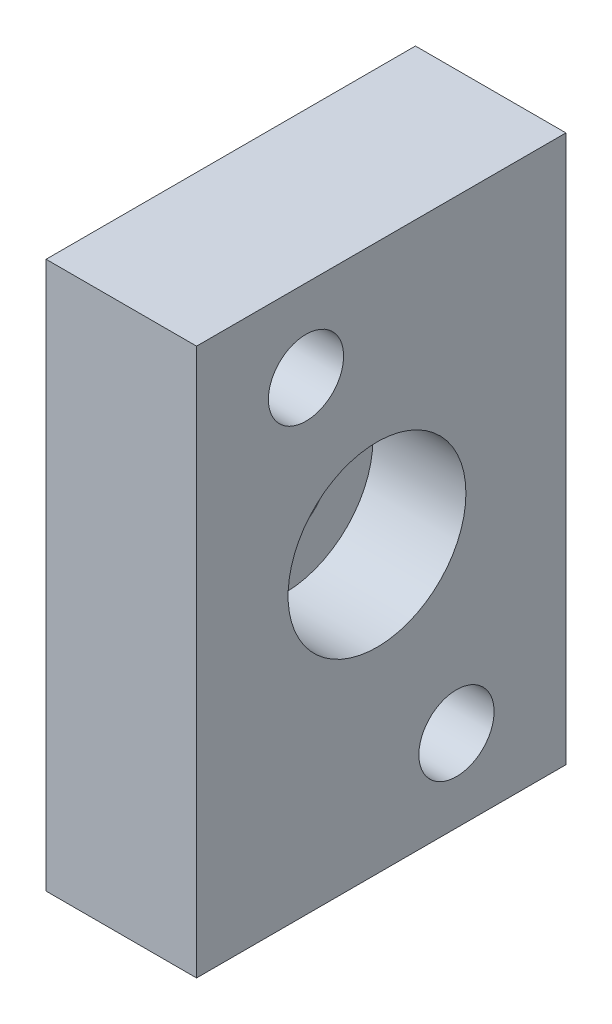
ISO-10303-21;
HEADER;
FILE_DESCRIPTION(('STEP AP214'),'2;1');
FILE_NAME('part.step','',(''),(''),'','','');
FILE_SCHEMA(('AUTOMOTIVE_DESIGN { 1 0 10303 214 1 1 1 1 }'));
ENDSEC;
DATA;
#1=APPLICATION_CONTEXT('core data for automotive mechanical design processes');
#2=APPLICATION_PROTOCOL_DEFINITION('international standard','automotive_design',2000,#1);
#3=PRODUCT_CONTEXT('',#1,'mechanical');
#4=PRODUCT('Part','Part','',(#3));
#5=PRODUCT_RELATED_PRODUCT_CATEGORY('part','',(#4));
#6=PRODUCT_DEFINITION_FORMATION('','',#4);
#7=PRODUCT_DEFINITION_CONTEXT('part definition',#1,'design');
#8=PRODUCT_DEFINITION('design','',#6,#7);
#9=PRODUCT_DEFINITION_SHAPE('','',#8);
#10=(LENGTH_UNIT() NAMED_UNIT(*) SI_UNIT(.MILLI.,.METRE.));
#11=(NAMED_UNIT(*) PLANE_ANGLE_UNIT() SI_UNIT($,.RADIAN.));
#12=(NAMED_UNIT(*) SI_UNIT($,.STERADIAN.) SOLID_ANGLE_UNIT());
#13=UNCERTAINTY_MEASURE_WITH_UNIT(LENGTH_MEASURE(1.E-05),#10,'distance_accuracy_value','');
#14=(GEOMETRIC_REPRESENTATION_CONTEXT(3) GLOBAL_UNCERTAINTY_ASSIGNED_CONTEXT((#13)) GLOBAL_UNIT_ASSIGNED_CONTEXT((#10,
#11,#12)) REPRESENTATION_CONTEXT('',''));
#15=CARTESIAN_POINT('',(0.,0.,0.));
#16=DIRECTION('',(0.,0.,1.));
#17=DIRECTION('',(1.,0.,0.));
#18=AXIS2_PLACEMENT_3D('',#15,#16,#17);
#19=CARTESIAN_POINT('',(110.,-61.85,-2.));
#20=DIRECTION('',(-1.,0.,0.));
#21=DIRECTION('',(0.,0.,-1.));
#22=AXIS2_PLACEMENT_3D('',#19,#20,#21);
#23=PLANE('',#22);
#24=CARTESIAN_POINT('',(110.,-55.85,-21.));
#25=DIRECTION('',(-1.,0.,0.));
#26=DIRECTION('',(0.,0.,1.));
#27=AXIS2_PLACEMENT_3D('',#24,#25,#26);
#28=CIRCLE('',#27,4.50000000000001);
#29=CARTESIAN_POINT('',(110.,-55.85,-16.5));
#30=VERTEX_POINT('',#29);
#31=EDGE_CURVE('E182',#30,#30,#28,.T.);
#32=ORIENTED_EDGE('',*,*,#31,.F.);
#33=EDGE_LOOP('',(#32));
#34=FACE_BOUND('',#33,.T.);
#35=CARTESIAN_POINT('',(110.,-27.85,-10.));
#36=DIRECTION('',(-1.,0.,0.));
#37=DIRECTION('',(0.,0.,1.));
#38=AXIS2_PLACEMENT_3D('',#35,#36,#37);
#39=CIRCLE('',#38,4.5);
#40=CARTESIAN_POINT('',(110.,-27.85,-5.5));
#41=VERTEX_POINT('',#40);
#42=EDGE_CURVE('E188',#41,#41,#39,.T.);
#43=ORIENTED_EDGE('',*,*,#42,.F.);
#44=EDGE_LOOP('',(#43));
#45=FACE_BOUND('',#44,.T.);
#46=CARTESIAN_POINT('',(110.,-41.01,-15.19));
#47=DIRECTION('',(1.,0.,0.));
#48=DIRECTION('',(0.,0.,-1.));
#49=AXIS2_PLACEMENT_3D('',#46,#47,#48);
#50=CIRCLE('',#49,3.2);
#51=CARTESIAN_POINT('',(110.,-41.01,-18.39));
#52=VERTEX_POINT('',#51);
#53=EDGE_CURVE('E197',#52,#52,#50,.T.);
#54=ORIENTED_EDGE('',*,*,#53,.T.);
#55=EDGE_LOOP('',(#54));
#56=FACE_BOUND('',#55,.T.);
#57=DIRECTION('',(0.,-1.,0.));
#58=VECTOR('',#57,1.);
#59=CARTESIAN_POINT('',(110.,-21.85,-2.));
#60=LINE('',#59,#58);
#61=CARTESIAN_POINT('',(110.,-21.85,-2.));
#62=VERTEX_POINT('',#61);
#63=CARTESIAN_POINT('',(110.,-61.85,-2.));
#64=VERTEX_POINT('',#63);
#65=EDGE_CURVE('E87',#62,#64,#60,.T.);
#66=ORIENTED_EDGE('',*,*,#65,.F.);
#67=DIRECTION('',(0.,0.,1.));
#68=VECTOR('',#67,1.);
#69=CARTESIAN_POINT('',(110.,-21.85,-29.));
#70=LINE('',#69,#68);
#71=CARTESIAN_POINT('',(110.,-21.85,-29.));
#72=VERTEX_POINT('',#71);
#73=EDGE_CURVE('E70',#72,#62,#70,.T.);
#74=ORIENTED_EDGE('',*,*,#73,.F.);
#75=DIRECTION('',(0.,1.,0.));
#76=VECTOR('',#75,1.);
#77=CARTESIAN_POINT('',(110.,-61.85,-29.));
#78=LINE('',#77,#76);
#79=CARTESIAN_POINT('',(110.,-61.85,-29.));
#80=VERTEX_POINT('',#79);
#81=EDGE_CURVE('E81',#80,#72,#78,.T.);
#82=ORIENTED_EDGE('',*,*,#81,.F.);
#83=DIRECTION('',(0.,0.,-1.));
#84=VECTOR('',#83,1.);
#85=CARTESIAN_POINT('',(110.,-61.85,-2.));
#86=LINE('',#85,#84);
#87=EDGE_CURVE('E91',#64,#80,#86,.T.);
#88=ORIENTED_EDGE('',*,*,#87,.F.);
#89=EDGE_LOOP('',(#66,#74,#82,#88));
#90=FACE_BOUND('',#89,.T.);
#91=ADVANCED_FACE('F34',(#34,#45,#56,#90),#23,.T.);
#92=CARTESIAN_POINT('',(120.,-21.85,-2.));
#93=DIRECTION('',(0.,0.,1.));
#94=DIRECTION('',(-1.,0.,0.));
#95=AXIS2_PLACEMENT_3D('',#92,#93,#94);
#96=PLANE('',#95);
#97=ORIENTED_EDGE('',*,*,#65,.T.);
#98=DIRECTION('',(-1.,0.,0.));
#99=VECTOR('',#98,1.);
#100=CARTESIAN_POINT('',(120.,-61.85,-2.));
#101=LINE('',#100,#99);
#102=CARTESIAN_POINT('',(121.,-61.85,-2.));
#103=VERTEX_POINT('',#102);
#104=EDGE_CURVE('E11',#103,#64,#101,.T.);
#105=ORIENTED_EDGE('',*,*,#104,.F.);
#106=DIRECTION('',(0.,-1.,0.));
#107=VECTOR('',#106,1.);
#108=CARTESIAN_POINT('',(121.,-21.85,-2.));
#109=LINE('',#108,#107);
#110=CARTESIAN_POINT('',(121.,-21.85,-2.));
#111=VERTEX_POINT('',#110);
#112=EDGE_CURVE('E80',#111,#103,#109,.T.);
#113=ORIENTED_EDGE('',*,*,#112,.F.);
#114=DIRECTION('',(-1.,0.,0.));
#115=VECTOR('',#114,1.);
#116=CARTESIAN_POINT('',(120.,-21.85,-2.));
#117=LINE('',#116,#115);
#118=EDGE_CURVE('E73',#111,#62,#117,.T.);
#119=ORIENTED_EDGE('',*,*,#118,.T.);
#120=EDGE_LOOP('',(#97,#105,#113,#119));
#121=FACE_BOUND('',#120,.T.);
#122=ADVANCED_FACE('F85',(#121),#96,.T.);
#123=CARTESIAN_POINT('',(120.,-61.85,-2.));
#124=DIRECTION('',(0.,-1.,0.));
#125=DIRECTION('',(0.,0.,-1.));
#126=AXIS2_PLACEMENT_3D('',#123,#124,#125);
#127=PLANE('',#126);
#128=ORIENTED_EDGE('',*,*,#87,.T.);
#129=DIRECTION('',(-1.,0.,0.));
#130=VECTOR('',#129,1.);
#131=CARTESIAN_POINT('',(120.,-61.85,-29.));
#132=LINE('',#131,#130);
#133=CARTESIAN_POINT('',(121.,-61.85,-29.));
#134=VERTEX_POINT('',#133);
#135=EDGE_CURVE('E44',#134,#80,#132,.T.);
#136=ORIENTED_EDGE('',*,*,#135,.F.);
#137=DIRECTION('',(0.,0.,-1.));
#138=VECTOR('',#137,1.);
#139=CARTESIAN_POINT('',(121.,-61.85,-2.));
#140=LINE('',#139,#138);
#141=EDGE_CURVE('E38',#103,#134,#140,.T.);
#142=ORIENTED_EDGE('',*,*,#141,.F.);
#143=ORIENTED_EDGE('',*,*,#104,.T.);
#144=EDGE_LOOP('',(#128,#136,#142,#143));
#145=FACE_BOUND('',#144,.T.);
#146=ADVANCED_FACE('F111',(#145),#127,.T.);
#147=CARTESIAN_POINT('',(120.,-61.85,-29.));
#148=DIRECTION('',(0.,0.,-1.));
#149=DIRECTION('',(1.,0.,0.));
#150=AXIS2_PLACEMENT_3D('',#147,#148,#149);
#151=PLANE('',#150);
#152=ORIENTED_EDGE('',*,*,#81,.T.);
#153=DIRECTION('',(-1.,0.,0.));
#154=VECTOR('',#153,1.);
#155=CARTESIAN_POINT('',(120.,-21.85,-29.));
#156=LINE('',#155,#154);
#157=CARTESIAN_POINT('',(121.,-21.85,-29.));
#158=VERTEX_POINT('',#157);
#159=EDGE_CURVE('E76',#158,#72,#156,.T.);
#160=ORIENTED_EDGE('',*,*,#159,.F.);
#161=DIRECTION('',(0.,1.,0.));
#162=VECTOR('',#161,1.);
#163=CARTESIAN_POINT('',(121.,-61.85,-29.));
#164=LINE('',#163,#162);
#165=EDGE_CURVE('E105',#134,#158,#164,.T.);
#166=ORIENTED_EDGE('',*,*,#165,.F.);
#167=ORIENTED_EDGE('',*,*,#135,.T.);
#168=EDGE_LOOP('',(#152,#160,#166,#167));
#169=FACE_BOUND('',#168,.T.);
#170=ADVANCED_FACE('F113',(#169),#151,.T.);
#171=CARTESIAN_POINT('',(120.,-21.85,-29.));
#172=DIRECTION('',(0.,1.,0.));
#173=DIRECTION('',(0.,0.,1.));
#174=AXIS2_PLACEMENT_3D('',#171,#172,#173);
#175=PLANE('',#174);
#176=ORIENTED_EDGE('',*,*,#73,.T.);
#177=ORIENTED_EDGE('',*,*,#118,.F.);
#178=DIRECTION('',(0.,0.,1.));
#179=VECTOR('',#178,1.);
#180=CARTESIAN_POINT('',(121.,-21.85,-29.));
#181=LINE('',#180,#179);
#182=EDGE_CURVE('E53',#158,#111,#181,.T.);
#183=ORIENTED_EDGE('',*,*,#182,.F.);
#184=ORIENTED_EDGE('',*,*,#159,.T.);
#185=EDGE_LOOP('',(#176,#177,#183,#184));
#186=FACE_BOUND('',#185,.T.);
#187=ADVANCED_FACE('F72',(#186),#175,.T.);
#188=CARTESIAN_POINT('',(121.,-61.85,-2.));
#189=DIRECTION('',(-1.,0.,0.));
#190=DIRECTION('',(0.,0.,-1.));
#191=AXIS2_PLACEMENT_3D('',#188,#189,#190);
#192=PLANE('',#191);
#193=CARTESIAN_POINT('',(121.,-55.85,-21.));
#194=DIRECTION('',(-1.,0.,0.));
#195=DIRECTION('',(0.,0.,1.));
#196=AXIS2_PLACEMENT_3D('',#193,#194,#195);
#197=CIRCLE('',#196,2.75);
#198=CARTESIAN_POINT('',(121.,-55.85,-18.25));
#199=VERTEX_POINT('',#198);
#200=EDGE_CURVE('E171',#199,#199,#197,.T.);
#201=ORIENTED_EDGE('',*,*,#200,.T.);
#202=EDGE_LOOP('',(#201));
#203=FACE_BOUND('',#202,.T.);
#204=CARTESIAN_POINT('',(121.,-27.85,-10.));
#205=DIRECTION('',(-1.,0.,0.));
#206=DIRECTION('',(0.,0.,1.));
#207=AXIS2_PLACEMENT_3D('',#204,#205,#206);
#208=CIRCLE('',#207,2.75);
#209=CARTESIAN_POINT('',(121.,-27.85,-7.25));
#210=VERTEX_POINT('',#209);
#211=EDGE_CURVE('E179',#210,#210,#208,.T.);
#212=ORIENTED_EDGE('',*,*,#211,.T.);
#213=EDGE_LOOP('',(#212));
#214=FACE_BOUND('',#213,.T.);
#215=CARTESIAN_POINT('',(121.,-41.01,-15.19));
#216=DIRECTION('',(1.,0.,0.));
#217=DIRECTION('',(0.,0.,-1.));
#218=AXIS2_PLACEMENT_3D('',#215,#216,#217);
#219=CIRCLE('',#218,6.5);
#220=CARTESIAN_POINT('',(121.,-41.01,-21.69));
#221=VERTEX_POINT('',#220);
#222=EDGE_CURVE('E96',#221,#221,#219,.T.);
#223=ORIENTED_EDGE('',*,*,#222,.F.);
#224=EDGE_LOOP('',(#223));
#225=FACE_BOUND('',#224,.T.);
#226=ORIENTED_EDGE('',*,*,#112,.T.);
#227=ORIENTED_EDGE('',*,*,#141,.T.);
#228=ORIENTED_EDGE('',*,*,#165,.T.);
#229=ORIENTED_EDGE('',*,*,#182,.T.);
#230=EDGE_LOOP('',(#226,#227,#228,#229));
#231=FACE_BOUND('',#230,.T.);
#232=ADVANCED_FACE('F36',(#203,#214,#225,#231),#192,.F.);
#233=CARTESIAN_POINT('',(114.2,-41.01,-15.19));
#234=DIRECTION('',(1.,0.,0.));
#235=DIRECTION('',(0.,0.,-1.));
#236=AXIS2_PLACEMENT_3D('',#233,#234,#235);
#237=CYLINDRICAL_SURFACE('',#236,6.5);
#238=CARTESIAN_POINT('',(114.2,-41.01,-15.19));
#239=DIRECTION('',(1.,0.,0.));
#240=DIRECTION('',(0.,0.,-1.));
#241=AXIS2_PLACEMENT_3D('',#238,#239,#240);
#242=CIRCLE('',#241,6.5);
#243=CARTESIAN_POINT('',(114.2,-41.01,-21.69));
#244=VERTEX_POINT('',#243);
#245=EDGE_CURVE('E92',#244,#244,#242,.T.);
#246=ORIENTED_EDGE('',*,*,#245,.F.);
#247=EDGE_LOOP('',(#246));
#248=FACE_BOUND('',#247,.T.);
#249=ORIENTED_EDGE('',*,*,#222,.T.);
#250=EDGE_LOOP('',(#249));
#251=FACE_BOUND('',#250,.T.);
#252=ADVANCED_FACE('F131',(#248,#251),#237,.F.);
#253=CARTESIAN_POINT('',(114.2,-41.01,-15.19));
#254=DIRECTION('',(1.,0.,0.));
#255=DIRECTION('',(0.,0.,-1.));
#256=AXIS2_PLACEMENT_3D('',#253,#254,#255);
#257=PLANE('',#256);
#258=CARTESIAN_POINT('',(114.2,-41.01,-15.19));
#259=DIRECTION('',(1.,0.,0.));
#260=DIRECTION('',(0.,0.,-1.));
#261=AXIS2_PLACEMENT_3D('',#258,#259,#260);
#262=CIRCLE('',#261,3.2);
#263=CARTESIAN_POINT('',(114.2,-41.01,-18.39));
#264=VERTEX_POINT('',#263);
#265=EDGE_CURVE('E194',#264,#264,#262,.T.);
#266=ORIENTED_EDGE('',*,*,#265,.F.);
#267=EDGE_LOOP('',(#266));
#268=FACE_BOUND('',#267,.T.);
#269=ORIENTED_EDGE('',*,*,#245,.T.);
#270=EDGE_LOOP('',(#269));
#271=FACE_BOUND('',#270,.T.);
#272=ADVANCED_FACE('F134',(#268,#271),#257,.T.);
#273=CARTESIAN_POINT('',(110.,-41.01,-15.19));
#274=DIRECTION('',(1.,0.,0.));
#275=DIRECTION('',(0.,0.,-1.));
#276=AXIS2_PLACEMENT_3D('',#273,#274,#275);
#277=CYLINDRICAL_SURFACE('',#276,3.2);
#278=ORIENTED_EDGE('',*,*,#53,.F.);
#279=EDGE_LOOP('',(#278));
#280=FACE_BOUND('',#279,.T.);
#281=ORIENTED_EDGE('',*,*,#265,.T.);
#282=EDGE_LOOP('',(#281));
#283=FACE_BOUND('',#282,.T.);
#284=ADVANCED_FACE('F138',(#280,#283),#277,.F.);
#285=CARTESIAN_POINT('',(115.2,-27.85,-10.));
#286=DIRECTION('',(-1.,0.,0.));
#287=DIRECTION('',(0.,0.,1.));
#288=AXIS2_PLACEMENT_3D('',#285,#286,#287);
#289=CYLINDRICAL_SURFACE('',#288,4.5);
#290=CARTESIAN_POINT('',(115.2,-27.85,-10.));
#291=DIRECTION('',(-1.,0.,0.));
#292=DIRECTION('',(0.,0.,1.));
#293=AXIS2_PLACEMENT_3D('',#290,#291,#292);
#294=CIRCLE('',#293,4.5);
#295=CARTESIAN_POINT('',(115.2,-27.85,-5.5));
#296=VERTEX_POINT('',#295);
#297=EDGE_CURVE('E191',#296,#296,#294,.T.);
#298=ORIENTED_EDGE('',*,*,#297,.F.);
#299=EDGE_LOOP('',(#298));
#300=FACE_BOUND('',#299,.T.);
#301=ORIENTED_EDGE('',*,*,#42,.T.);
#302=EDGE_LOOP('',(#301));
#303=FACE_BOUND('',#302,.T.);
#304=ADVANCED_FACE('F142',(#300,#303),#289,.F.);
#305=CARTESIAN_POINT('',(115.2,-27.85,-10.));
#306=DIRECTION('',(-1.,0.,0.));
#307=DIRECTION('',(0.,0.,1.));
#308=AXIS2_PLACEMENT_3D('',#305,#306,#307);
#309=PLANE('',#308);
#310=CARTESIAN_POINT('',(115.2,-27.85,-10.));
#311=DIRECTION('',(-1.,0.,0.));
#312=DIRECTION('',(0.,0.,1.));
#313=AXIS2_PLACEMENT_3D('',#310,#311,#312);
#314=CIRCLE('',#313,2.75);
#315=CARTESIAN_POINT('',(115.2,-27.85,-7.25));
#316=VERTEX_POINT('',#315);
#317=EDGE_CURVE('E176',#316,#316,#314,.T.);
#318=ORIENTED_EDGE('',*,*,#317,.F.);
#319=EDGE_LOOP('',(#318));
#320=FACE_BOUND('',#319,.T.);
#321=ORIENTED_EDGE('',*,*,#297,.T.);
#322=EDGE_LOOP('',(#321));
#323=FACE_BOUND('',#322,.T.);
#324=ADVANCED_FACE('F146',(#320,#323),#309,.T.);
#325=CARTESIAN_POINT('',(115.2,-55.85,-21.));
#326=DIRECTION('',(-1.,0.,0.));
#327=DIRECTION('',(0.,0.,1.));
#328=AXIS2_PLACEMENT_3D('',#325,#326,#327);
#329=CYLINDRICAL_SURFACE('',#328,4.50000000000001);
#330=CARTESIAN_POINT('',(115.2,-55.85,-21.));
#331=DIRECTION('',(-1.,0.,0.));
#332=DIRECTION('',(0.,0.,1.));
#333=AXIS2_PLACEMENT_3D('',#330,#331,#332);
#334=CIRCLE('',#333,4.50000000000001);
#335=CARTESIAN_POINT('',(115.2,-55.85,-16.5));
#336=VERTEX_POINT('',#335);
#337=EDGE_CURVE('E185',#336,#336,#334,.T.);
#338=ORIENTED_EDGE('',*,*,#337,.F.);
#339=EDGE_LOOP('',(#338));
#340=FACE_BOUND('',#339,.T.);
#341=ORIENTED_EDGE('',*,*,#31,.T.);
#342=EDGE_LOOP('',(#341));
#343=FACE_BOUND('',#342,.T.);
#344=ADVANCED_FACE('F150',(#340,#343),#329,.F.);
#345=CARTESIAN_POINT('',(115.2,-55.85,-21.));
#346=DIRECTION('',(-1.,0.,0.));
#347=DIRECTION('',(0.,0.,1.));
#348=AXIS2_PLACEMENT_3D('',#345,#346,#347);
#349=PLANE('',#348);
#350=CARTESIAN_POINT('',(115.2,-55.85,-21.));
#351=DIRECTION('',(-1.,0.,0.));
#352=DIRECTION('',(0.,0.,1.));
#353=AXIS2_PLACEMENT_3D('',#350,#351,#352);
#354=CIRCLE('',#353,2.75);
#355=CARTESIAN_POINT('',(115.2,-55.85,-18.25));
#356=VERTEX_POINT('',#355);
#357=EDGE_CURVE('E174',#356,#356,#354,.T.);
#358=ORIENTED_EDGE('',*,*,#357,.F.);
#359=EDGE_LOOP('',(#358));
#360=FACE_BOUND('',#359,.T.);
#361=ORIENTED_EDGE('',*,*,#337,.T.);
#362=EDGE_LOOP('',(#361));
#363=FACE_BOUND('',#362,.T.);
#364=ADVANCED_FACE('F154',(#360,#363),#349,.T.);
#365=CARTESIAN_POINT('',(121.,-27.85,-10.));
#366=DIRECTION('',(-1.,0.,0.));
#367=DIRECTION('',(0.,0.,1.));
#368=AXIS2_PLACEMENT_3D('',#365,#366,#367);
#369=CYLINDRICAL_SURFACE('',#368,2.75);
#370=ORIENTED_EDGE('',*,*,#211,.F.);
#371=EDGE_LOOP('',(#370));
#372=FACE_BOUND('',#371,.T.);
#373=ORIENTED_EDGE('',*,*,#317,.T.);
#374=EDGE_LOOP('',(#373));
#375=FACE_BOUND('',#374,.T.);
#376=ADVANCED_FACE('F158',(#372,#375),#369,.F.);
#377=CARTESIAN_POINT('',(121.,-55.85,-21.));
#378=DIRECTION('',(-1.,0.,0.));
#379=DIRECTION('',(0.,0.,1.));
#380=AXIS2_PLACEMENT_3D('',#377,#378,#379);
#381=CYLINDRICAL_SURFACE('',#380,2.75);
#382=ORIENTED_EDGE('',*,*,#200,.F.);
#383=EDGE_LOOP('',(#382));
#384=FACE_BOUND('',#383,.T.);
#385=ORIENTED_EDGE('',*,*,#357,.T.);
#386=EDGE_LOOP('',(#385));
#387=FACE_BOUND('',#386,.T.);
#388=ADVANCED_FACE('F162',(#384,#387),#381,.F.);
#389=CLOSED_SHELL('',(#91,#122,#146,#170,#187,#232,#252,#272,#284,#304,#324,#344,#364,#376,#388));
#390=MANIFOLD_SOLID_BREP('B2',#389);
#391=ADVANCED_BREP_SHAPE_REPRESENTATION('',(#18,#390),#14);
#392=SHAPE_DEFINITION_REPRESENTATION(#9,#391);
ENDSEC;
END-ISO-10303-21;
